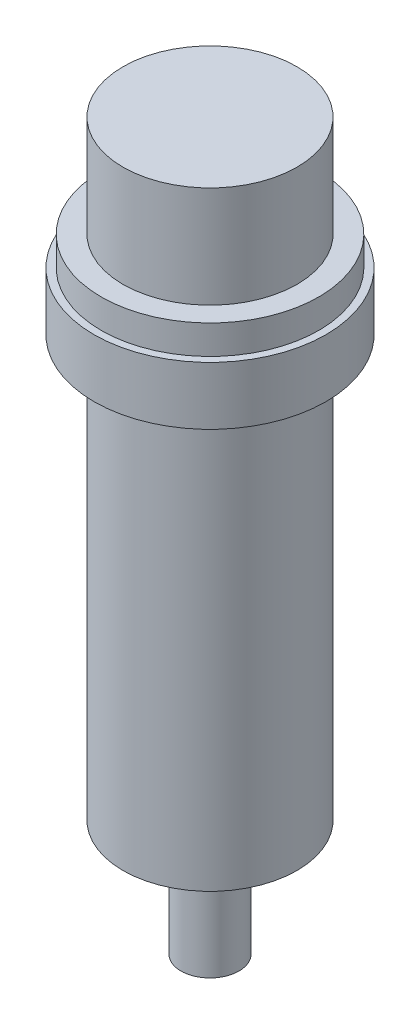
ISO-10303-21;
HEADER;
FILE_DESCRIPTION(('STEP AP214'),'2;1');
FILE_NAME('part.step','',(''),(''),'','','');
FILE_SCHEMA(('AUTOMOTIVE_DESIGN { 1 0 10303 214 1 1 1 1 }'));
ENDSEC;
DATA;
#1=APPLICATION_CONTEXT('core data for automotive mechanical design processes');
#2=APPLICATION_PROTOCOL_DEFINITION('international standard','automotive_design',2000,#1);
#3=PRODUCT_CONTEXT('',#1,'mechanical');
#4=PRODUCT('Part','Part','',(#3));
#5=PRODUCT_RELATED_PRODUCT_CATEGORY('part','',(#4));
#6=PRODUCT_DEFINITION_FORMATION('','',#4);
#7=PRODUCT_DEFINITION_CONTEXT('part definition',#1,'design');
#8=PRODUCT_DEFINITION('design','',#6,#7);
#9=PRODUCT_DEFINITION_SHAPE('','',#8);
#10=(LENGTH_UNIT() NAMED_UNIT(*) SI_UNIT(.MILLI.,.METRE.));
#11=(NAMED_UNIT(*) PLANE_ANGLE_UNIT() SI_UNIT($,.RADIAN.));
#12=(NAMED_UNIT(*) SI_UNIT($,.STERADIAN.) SOLID_ANGLE_UNIT());
#13=UNCERTAINTY_MEASURE_WITH_UNIT(LENGTH_MEASURE(1.E-05),#10,'distance_accuracy_value','');
#14=(GEOMETRIC_REPRESENTATION_CONTEXT(3) GLOBAL_UNCERTAINTY_ASSIGNED_CONTEXT((#13)) GLOBAL_UNIT_ASSIGNED_CONTEXT((#10,
#11,#12)) REPRESENTATION_CONTEXT('',''));
#15=CARTESIAN_POINT('',(0.,0.,0.));
#16=DIRECTION('',(0.,0.,1.));
#17=DIRECTION('',(1.,0.,0.));
#18=AXIS2_PLACEMENT_3D('',#15,#16,#17);
#19=CARTESIAN_POINT('',(0.,-29.,0.));
#20=DIRECTION('',(0.,-1.,0.));
#21=DIRECTION('',(0.,0.,-1.));
#22=AXIS2_PLACEMENT_3D('',#19,#20,#21);
#23=PLANE('',#22);
#24=CARTESIAN_POINT('',(0.,-29.,0.));
#25=DIRECTION('',(0.,-1.,0.));
#26=DIRECTION('',(0.,0.,-1.));
#27=AXIS2_PLACEMENT_3D('',#24,#25,#26);
#28=CIRCLE('',#27,6.);
#29=CARTESIAN_POINT('',(0.,-29.,6.));
#30=VERTEX_POINT('',#29);
#31=EDGE_CURVE('E55',#30,#30,#28,.T.);
#32=ORIENTED_EDGE('',*,*,#31,.T.);
#33=EDGE_LOOP('',(#32));
#34=FACE_BOUND('',#33,.T.);
#35=CARTESIAN_POINT('',(0.,-29.,0.));
#36=DIRECTION('',(0.,-1.,0.));
#37=DIRECTION('',(0.,0.,-1.));
#38=AXIS2_PLACEMENT_3D('',#35,#36,#37);
#39=CIRCLE('',#38,2.);
#40=CARTESIAN_POINT('',(0.,-29.,-2.));
#41=VERTEX_POINT('',#40);
#42=EDGE_CURVE('E61',#41,#41,#39,.T.);
#43=ORIENTED_EDGE('',*,*,#42,.F.);
#44=EDGE_LOOP('',(#43));
#45=FACE_BOUND('',#44,.T.);
#46=ADVANCED_FACE('F28',(#34,#45),#23,.T.);
#47=CARTESIAN_POINT('',(0.,0.,0.));
#48=DIRECTION('',(0.,1.,0.));
#49=DIRECTION('',(0.,0.,1.));
#50=AXIS2_PLACEMENT_3D('',#47,#48,#49);
#51=PLANE('',#50);
#52=CARTESIAN_POINT('',(0.,0.,0.));
#53=DIRECTION('',(0.,1.,0.));
#54=DIRECTION('',(0.,0.,1.));
#55=AXIS2_PLACEMENT_3D('',#52,#53,#54);
#56=CIRCLE('',#55,8.);
#57=CARTESIAN_POINT('',(0.,0.,8.));
#58=VERTEX_POINT('',#57);
#59=EDGE_CURVE('E39',#58,#58,#56,.T.);
#60=ORIENTED_EDGE('',*,*,#59,.F.);
#61=EDGE_LOOP('',(#60));
#62=FACE_BOUND('',#61,.T.);
#63=CARTESIAN_POINT('',(0.,0.,0.));
#64=DIRECTION('',(0.,1.,0.));
#65=DIRECTION('',(0.,0.,1.));
#66=AXIS2_PLACEMENT_3D('',#63,#64,#65);
#67=CIRCLE('',#66,6.);
#68=CARTESIAN_POINT('',(0.,0.,6.));
#69=VERTEX_POINT('',#68);
#70=EDGE_CURVE('E10',#69,#69,#67,.F.);
#71=ORIENTED_EDGE('',*,*,#70,.F.);
#72=EDGE_LOOP('',(#71));
#73=FACE_BOUND('',#72,.T.);
#74=ADVANCED_FACE('F77',(#62,#73),#51,.F.);
#75=CARTESIAN_POINT('',(0.,6.,0.));
#76=DIRECTION('',(0.,1.,0.));
#77=DIRECTION('',(0.,0.,1.));
#78=AXIS2_PLACEMENT_3D('',#75,#76,#77);
#79=PLANE('',#78);
#80=CARTESIAN_POINT('',(0.,6.,0.));
#81=DIRECTION('',(0.,1.,0.));
#82=DIRECTION('',(0.,0.,1.));
#83=AXIS2_PLACEMENT_3D('',#80,#81,#82);
#84=CIRCLE('',#83,7.5);
#85=CARTESIAN_POINT('',(0.,6.,7.5));
#86=VERTEX_POINT('',#85);
#87=EDGE_CURVE('E44',#86,#86,#84,.T.);
#88=ORIENTED_EDGE('',*,*,#87,.T.);
#89=EDGE_LOOP('',(#88));
#90=FACE_BOUND('',#89,.T.);
#91=CARTESIAN_POINT('',(0.,6.,0.));
#92=DIRECTION('',(0.,1.,0.));
#93=DIRECTION('',(0.,0.,1.));
#94=AXIS2_PLACEMENT_3D('',#91,#92,#93);
#95=CIRCLE('',#94,6.);
#96=CARTESIAN_POINT('',(0.,6.,6.));
#97=VERTEX_POINT('',#96);
#98=EDGE_CURVE('E52',#97,#97,#95,.T.);
#99=ORIENTED_EDGE('',*,*,#98,.F.);
#100=EDGE_LOOP('',(#99));
#101=FACE_BOUND('',#100,.T.);
#102=ADVANCED_FACE('F83',(#90,#101),#79,.T.);
#103=CARTESIAN_POINT('',(0.,4.,0.));
#104=DIRECTION('',(0.,1.,0.));
#105=DIRECTION('',(0.,0.,1.));
#106=AXIS2_PLACEMENT_3D('',#103,#104,#105);
#107=PLANE('',#106);
#108=CARTESIAN_POINT('',(0.,4.,0.));
#109=DIRECTION('',(0.,1.,0.));
#110=DIRECTION('',(0.,0.,1.));
#111=AXIS2_PLACEMENT_3D('',#108,#109,#110);
#112=CIRCLE('',#111,8.);
#113=CARTESIAN_POINT('',(0.,4.,8.));
#114=VERTEX_POINT('',#113);
#115=EDGE_CURVE('E35',#114,#114,#112,.T.);
#116=ORIENTED_EDGE('',*,*,#115,.T.);
#117=EDGE_LOOP('',(#116));
#118=FACE_BOUND('',#117,.T.);
#119=CARTESIAN_POINT('',(0.,4.,0.));
#120=DIRECTION('',(0.,1.,0.));
#121=DIRECTION('',(0.,0.,1.));
#122=AXIS2_PLACEMENT_3D('',#119,#120,#121);
#123=CIRCLE('',#122,7.5);
#124=CARTESIAN_POINT('',(0.,4.,7.5));
#125=VERTEX_POINT('',#124);
#126=EDGE_CURVE('E46',#125,#125,#123,.T.);
#127=ORIENTED_EDGE('',*,*,#126,.F.);
#128=EDGE_LOOP('',(#127));
#129=FACE_BOUND('',#128,.T.);
#130=ADVANCED_FACE('F101',(#118,#129),#107,.T.);
#131=CARTESIAN_POINT('',(0.,4.,0.));
#132=DIRECTION('',(0.,-1.,0.));
#133=DIRECTION('',(0.,0.,-1.));
#134=AXIS2_PLACEMENT_3D('',#131,#132,#133);
#135=CYLINDRICAL_SURFACE('',#134,8.);
#136=ORIENTED_EDGE('',*,*,#115,.F.);
#137=EDGE_LOOP('',(#136));
#138=FACE_BOUND('',#137,.T.);
#139=ORIENTED_EDGE('',*,*,#59,.T.);
#140=EDGE_LOOP('',(#139));
#141=FACE_BOUND('',#140,.T.);
#142=ADVANCED_FACE('F30',(#138,#141),#135,.T.);
#143=CARTESIAN_POINT('',(0.,6.,0.));
#144=DIRECTION('',(0.,-1.,0.));
#145=DIRECTION('',(0.,0.,-1.));
#146=AXIS2_PLACEMENT_3D('',#143,#144,#145);
#147=CYLINDRICAL_SURFACE('',#146,7.5);
#148=ORIENTED_EDGE('',*,*,#87,.F.);
#149=EDGE_LOOP('',(#148));
#150=FACE_BOUND('',#149,.T.);
#151=ORIENTED_EDGE('',*,*,#126,.T.);
#152=EDGE_LOOP('',(#151));
#153=FACE_BOUND('',#152,.T.);
#154=ADVANCED_FACE('F97',(#150,#153),#147,.T.);
#155=CARTESIAN_POINT('',(0.,13.,0.));
#156=DIRECTION('',(0.,-1.,0.));
#157=DIRECTION('',(0.,0.,-1.));
#158=AXIS2_PLACEMENT_3D('',#155,#156,#157);
#159=CYLINDRICAL_SURFACE('',#158,6.);
#160=CARTESIAN_POINT('',(0.,13.,0.));
#161=DIRECTION('',(0.,1.,0.));
#162=DIRECTION('',(0.,0.,1.));
#163=AXIS2_PLACEMENT_3D('',#160,#161,#162);
#164=CIRCLE('',#163,6.);
#165=CARTESIAN_POINT('',(0.,13.,6.));
#166=VERTEX_POINT('',#165);
#167=EDGE_CURVE('E49',#166,#166,#164,.T.);
#168=ORIENTED_EDGE('',*,*,#167,.F.);
#169=EDGE_LOOP('',(#168));
#170=FACE_BOUND('',#169,.T.);
#171=ORIENTED_EDGE('',*,*,#98,.T.);
#172=EDGE_LOOP('',(#171));
#173=FACE_BOUND('',#172,.T.);
#174=ADVANCED_FACE('F93',(#170,#173),#159,.T.);
#175=CARTESIAN_POINT('',(0.,13.,0.));
#176=DIRECTION('',(0.,1.,0.));
#177=DIRECTION('',(0.,0.,1.));
#178=AXIS2_PLACEMENT_3D('',#175,#176,#177);
#179=PLANE('',#178);
#180=ORIENTED_EDGE('',*,*,#167,.T.);
#181=EDGE_LOOP('',(#180));
#182=FACE_BOUND('',#181,.T.);
#183=ADVANCED_FACE('F89',(#182),#179,.T.);
#184=CARTESIAN_POINT('',(0.,-29.,0.));
#185=DIRECTION('',(0.,1.,0.));
#186=DIRECTION('',(0.,0.,1.));
#187=AXIS2_PLACEMENT_3D('',#184,#185,#186);
#188=CYLINDRICAL_SURFACE('',#187,6.);
#189=CARTESIAN_POINT('',(0.,-29.,6.));
#190=CARTESIAN_POINT('',(0.,-28.6979166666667,6.));
#191=CARTESIAN_POINT('',(0.,-28.3958333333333,6.));
#192=CARTESIAN_POINT('',(0.,-27.7916666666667,6.));
#193=CARTESIAN_POINT('',(0.,-27.4895833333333,6.));
#194=CARTESIAN_POINT('',(0.,-26.8854166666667,6.));
#195=CARTESIAN_POINT('',(0.,-26.5833333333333,6.));
#196=CARTESIAN_POINT('',(0.,-25.9791666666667,6.));
#197=CARTESIAN_POINT('',(0.,-25.6770833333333,6.));
#198=CARTESIAN_POINT('',(0.,-25.0729166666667,6.));
#199=CARTESIAN_POINT('',(0.,-24.7708333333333,6.));
#200=CARTESIAN_POINT('',(0.,-24.1666666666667,6.));
#201=CARTESIAN_POINT('',(0.,-23.8645833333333,6.));
#202=CARTESIAN_POINT('',(0.,-23.2604166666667,6.));
#203=CARTESIAN_POINT('',(0.,-22.9583333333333,6.));
#204=CARTESIAN_POINT('',(0.,-22.3541666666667,6.));
#205=CARTESIAN_POINT('',(0.,-22.0520833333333,6.));
#206=CARTESIAN_POINT('',(0.,-21.4479166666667,6.));
#207=CARTESIAN_POINT('',(0.,-21.1458333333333,6.));
#208=CARTESIAN_POINT('',(0.,-20.5416666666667,6.));
#209=CARTESIAN_POINT('',(0.,-20.2395833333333,6.));
#210=CARTESIAN_POINT('',(0.,-19.6354166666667,6.));
#211=CARTESIAN_POINT('',(0.,-19.3333333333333,6.));
#212=CARTESIAN_POINT('',(0.,-18.7291666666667,6.));
#213=CARTESIAN_POINT('',(0.,-18.4270833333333,6.));
#214=CARTESIAN_POINT('',(0.,-17.8229166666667,6.));
#215=CARTESIAN_POINT('',(0.,-17.5208333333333,6.));
#216=CARTESIAN_POINT('',(0.,-16.9166666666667,6.));
#217=CARTESIAN_POINT('',(0.,-16.6145833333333,6.));
#218=CARTESIAN_POINT('',(0.,-16.0104166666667,6.));
#219=CARTESIAN_POINT('',(0.,-15.7083333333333,6.));
#220=CARTESIAN_POINT('',(0.,-15.1041666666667,6.));
#221=CARTESIAN_POINT('',(0.,-14.8020833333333,6.));
#222=CARTESIAN_POINT('',(0.,-14.1979166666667,6.));
#223=CARTESIAN_POINT('',(0.,-13.8958333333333,6.));
#224=CARTESIAN_POINT('',(0.,-13.2916666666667,6.));
#225=CARTESIAN_POINT('',(0.,-12.9895833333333,6.));
#226=CARTESIAN_POINT('',(0.,-12.3854166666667,6.));
#227=CARTESIAN_POINT('',(0.,-12.0833333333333,6.));
#228=CARTESIAN_POINT('',(0.,-11.4791666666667,6.));
#229=CARTESIAN_POINT('',(0.,-11.1770833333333,6.));
#230=CARTESIAN_POINT('',(0.,-10.5729166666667,6.));
#231=CARTESIAN_POINT('',(0.,-10.2708333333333,6.));
#232=CARTESIAN_POINT('',(0.,-9.66666666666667,6.));
#233=CARTESIAN_POINT('',(0.,-9.36458333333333,6.));
#234=CARTESIAN_POINT('',(0.,-8.76041666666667,6.));
#235=CARTESIAN_POINT('',(0.,-8.45833333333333,6.));
#236=CARTESIAN_POINT('',(0.,-7.85416666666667,6.));
#237=CARTESIAN_POINT('',(0.,-7.55208333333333,6.));
#238=CARTESIAN_POINT('',(0.,-6.94791666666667,6.));
#239=CARTESIAN_POINT('',(0.,-6.64583333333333,6.));
#240=CARTESIAN_POINT('',(0.,-6.04166666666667,6.));
#241=CARTESIAN_POINT('',(0.,-5.73958333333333,6.));
#242=CARTESIAN_POINT('',(0.,-5.13541666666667,6.));
#243=CARTESIAN_POINT('',(0.,-4.83333333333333,6.));
#244=CARTESIAN_POINT('',(0.,-4.22916666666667,6.));
#245=CARTESIAN_POINT('',(0.,-3.92708333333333,6.));
#246=CARTESIAN_POINT('',(0.,-3.32291666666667,6.));
#247=CARTESIAN_POINT('',(0.,-3.02083333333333,6.));
#248=CARTESIAN_POINT('',(0.,-2.41666666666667,6.));
#249=CARTESIAN_POINT('',(0.,-2.11458333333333,6.));
#250=CARTESIAN_POINT('',(0.,-1.51041666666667,6.));
#251=CARTESIAN_POINT('',(0.,-1.20833333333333,6.));
#252=CARTESIAN_POINT('',(0.,-0.604166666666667,6.));
#253=CARTESIAN_POINT('',(0.,-0.302083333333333,6.));
#254=CARTESIAN_POINT('',(0.,0.,6.));
#255=B_SPLINE_CURVE_WITH_KNOTS('',3,(#189,#190,#191,#192,#193,#194,#195,#196,#197,#198,#199,
#200,#201,#202,#203,#204,#205,#206,#207,#208,#209,#210,#211,#212,#213,#214,#215,#216,#217,#218,
#219,#220,#221,#222,#223,#224,#225,#226,#227,#228,#229,#230,#231,#232,#233,#234,#235,#236,#237,
#238,#239,#240,#241,#242,#243,#244,#245,#246,#247,#248,#249,#250,#251,#252,#253,#254),
.UNSPECIFIED.,.F.,.F.,(4,2,2,2,2,2,2,2,2,2,2,2,2,2,2,2,2,2,2,2,2,2,2,2,2,2,2,2,2,2,2,2,4),(0.,
0.906250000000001,1.8125,2.71875,3.625,4.53125,5.4375,6.34375,7.25,8.15625,9.0625,9.96875,
10.875,11.78125,12.6875,13.59375,14.5,15.40625,16.3125,17.21875,18.125,19.03125,19.9375,
20.84375,21.75,22.65625,23.5625,24.46875,25.375,26.28125,27.1875,28.09375,29.),.UNSPECIFIED.);
#256=EDGE_CURVE('BSEAM72',#30,#69,#255,.T.);
#257=ORIENTED_EDGE('',*,*,#31,.F.);
#258=ORIENTED_EDGE('',*,*,#70,.T.);
#259=ORIENTED_EDGE('',*,*,#256,.T.);
#260=ORIENTED_EDGE('',*,*,#256,.F.);
#261=EDGE_LOOP('',(#257,#259,#258,#260));
#262=FACE_BOUND('',#261,.T.);
#263=ADVANCED_FACE('F72',(#262),#188,.T.);
#264=CARTESIAN_POINT('',(0.,-37.,0.));
#265=DIRECTION('',(0.,1.,0.));
#266=DIRECTION('',(0.,0.,1.));
#267=AXIS2_PLACEMENT_3D('',#264,#265,#266);
#268=CYLINDRICAL_SURFACE('',#267,2.);
#269=CARTESIAN_POINT('',(0.,-37.,0.));
#270=DIRECTION('',(0.,-1.,0.));
#271=DIRECTION('',(0.,0.,-1.));
#272=AXIS2_PLACEMENT_3D('',#269,#270,#271);
#273=CIRCLE('',#272,2.);
#274=CARTESIAN_POINT('',(0.,-37.,-2.));
#275=VERTEX_POINT('',#274);
#276=EDGE_CURVE('E60',#275,#275,#273,.T.);
#277=ORIENTED_EDGE('',*,*,#276,.F.);
#278=EDGE_LOOP('',(#277));
#279=FACE_BOUND('',#278,.T.);
#280=ORIENTED_EDGE('',*,*,#42,.T.);
#281=EDGE_LOOP('',(#280));
#282=FACE_BOUND('',#281,.T.);
#283=ADVANCED_FACE('F69',(#279,#282),#268,.T.);
#284=CARTESIAN_POINT('',(0.,-37.,0.));
#285=DIRECTION('',(0.,-1.,0.));
#286=DIRECTION('',(0.,0.,-1.));
#287=AXIS2_PLACEMENT_3D('',#284,#285,#286);
#288=PLANE('',#287);
#289=ORIENTED_EDGE('',*,*,#276,.T.);
#290=EDGE_LOOP('',(#289));
#291=FACE_BOUND('',#290,.T.);
#292=ADVANCED_FACE('F67',(#291),#288,.T.);
#293=CLOSED_SHELL('',(#46,#74,#102,#130,#142,#154,#174,#183,#263,#283,#292));
#294=MANIFOLD_SOLID_BREP('B2',#293);
#295=ADVANCED_BREP_SHAPE_REPRESENTATION('',(#18,#294),#14);
#296=SHAPE_DEFINITION_REPRESENTATION(#9,#295);
ENDSEC;
END-ISO-10303-21;
